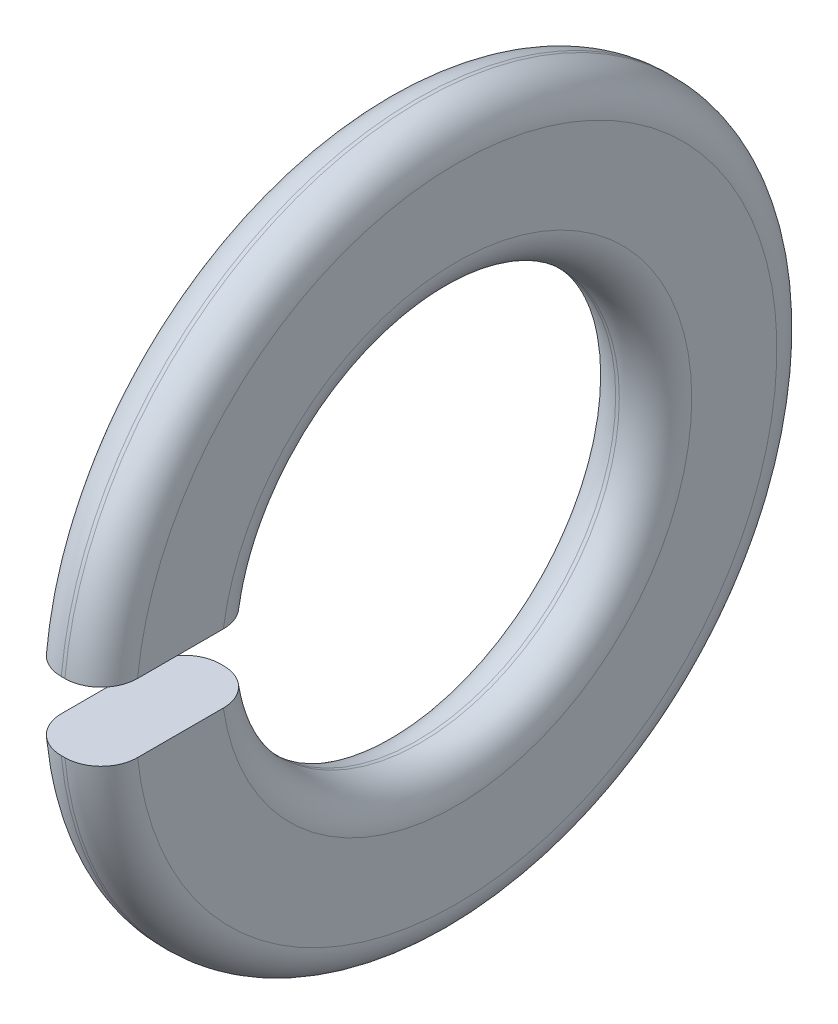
ISO-10303-21;
HEADER;
FILE_DESCRIPTION(('STEP AP214'),'2;1');
FILE_NAME('part.step','',(''),(''),'','','');
FILE_SCHEMA(('AUTOMOTIVE_DESIGN { 1 0 10303 214 1 1 1 1 }'));
ENDSEC;
DATA;
#1=APPLICATION_CONTEXT('core data for automotive mechanical design processes');
#2=APPLICATION_PROTOCOL_DEFINITION('international standard','automotive_design',2000,#1);
#3=PRODUCT_CONTEXT('',#1,'mechanical');
#4=PRODUCT('Part','Part','',(#3));
#5=PRODUCT_RELATED_PRODUCT_CATEGORY('part','',(#4));
#6=PRODUCT_DEFINITION_FORMATION('','',#4);
#7=PRODUCT_DEFINITION_CONTEXT('part definition',#1,'design');
#8=PRODUCT_DEFINITION('design','',#6,#7);
#9=PRODUCT_DEFINITION_SHAPE('','',#8);
#10=(LENGTH_UNIT() NAMED_UNIT(*) SI_UNIT(.MILLI.,.METRE.));
#11=(NAMED_UNIT(*) PLANE_ANGLE_UNIT() SI_UNIT($,.RADIAN.));
#12=(NAMED_UNIT(*) SI_UNIT($,.STERADIAN.) SOLID_ANGLE_UNIT());
#13=UNCERTAINTY_MEASURE_WITH_UNIT(LENGTH_MEASURE(1.E-05),#10,'distance_accuracy_value','');
#14=(GEOMETRIC_REPRESENTATION_CONTEXT(3) GLOBAL_UNCERTAINTY_ASSIGNED_CONTEXT((#13)) GLOBAL_UNIT_ASSIGNED_CONTEXT((#10,
#11,#12)) REPRESENTATION_CONTEXT('',''));
#15=CARTESIAN_POINT('',(0.,0.,0.));
#16=DIRECTION('',(0.,0.,1.));
#17=DIRECTION('',(1.,0.,0.));
#18=AXIS2_PLACEMENT_3D('',#15,#16,#17);
#19=CARTESIAN_POINT('',(-1.1,0.,0.));
#20=DIRECTION('',(-1.,0.,0.));
#21=DIRECTION('',(0.,0.,1.));
#22=AXIS2_PLACEMENT_3D('',#19,#20,#21);
#23=TOROIDAL_SURFACE('',#22,6.5,1.);
#24=CARTESIAN_POINT('',(-1.1,0.,0.));
#25=DIRECTION('',(-1.,0.,0.));
#26=DIRECTION('',(0.,0.,1.));
#27=AXIS2_PLACEMENT_3D('',#24,#25,#26);
#28=CIRCLE('',#27,5.5);
#29=CARTESIAN_POINT('',(-1.1,0.945,5.41820772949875));
#30=VERTEX_POINT('',#29);
#31=CARTESIAN_POINT('',(-1.1,-0.945,5.41820772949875));
#32=VERTEX_POINT('',#31);
#33=EDGE_CURVE('E123',#30,#32,#28,.T.);
#34=ORIENTED_EDGE('',*,*,#33,.F.);
#35=CARTESIAN_POINT('',(-1.50070397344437,0.945,5.50324566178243));
#36=CARTESIAN_POINT('',(-1.55223375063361,0.945,5.52611502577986));
#37=CARTESIAN_POINT('',(-1.60185220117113,0.945,5.55339994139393));
#38=CARTESIAN_POINT('',(-1.69582434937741,0.945,5.61596536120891));
#39=CARTESIAN_POINT('',(-1.74017082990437,0.945,5.65125663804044));
#40=CARTESIAN_POINT('',(-1.82228889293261,0.945,5.7287251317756));
#41=CARTESIAN_POINT('',(-1.86006736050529,0.945,5.77089504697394));
#42=CARTESIAN_POINT('',(-1.92807892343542,0.945,5.86091204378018));
#43=CARTESIAN_POINT('',(-1.95831385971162,0.945,5.90875773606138));
#44=CARTESIAN_POINT('',(-2.01071051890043,0.945,6.00927737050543));
#45=CARTESIAN_POINT('',(-2.0327907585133,0.945,6.06199379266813));
#46=CARTESIAN_POINT('',(-2.06786939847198,0.945,6.17036943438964));
#47=CARTESIAN_POINT('',(-2.08086696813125,0.945,6.22602892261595));
#48=CARTESIAN_POINT('',(-2.09748980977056,0.945,6.33918774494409));
#49=CARTESIAN_POINT('',(-2.10103920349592,0.945,6.39669824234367));
#50=CARTESIAN_POINT('',(-2.09843562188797,0.945,6.51150031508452));
#51=CARTESIAN_POINT('',(-2.09228255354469,0.945,6.56879188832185));
#52=CARTESIAN_POINT('',(-2.0704211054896,0.945,6.68153422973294));
#53=CARTESIAN_POINT('',(-2.05471107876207,0.945,6.7369846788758));
#54=CARTESIAN_POINT('',(-2.0141479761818,0.945,6.8444352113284));
#55=CARTESIAN_POINT('',(-1.98929515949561,0.945,6.89643539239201));
#56=CARTESIAN_POINT('',(-1.93130313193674,0.945,6.9951627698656));
#57=CARTESIAN_POINT('',(-1.89821545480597,0.945,7.04192023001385));
#58=CARTESIAN_POINT('',(-1.82459490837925,0.945,7.12915297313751));
#59=CARTESIAN_POINT('',(-1.78406237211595,0.945,7.16962853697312));
#60=CARTESIAN_POINT('',(-1.69708643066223,0.945,7.24276744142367));
#61=CARTESIAN_POINT('',(-1.65069837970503,0.945,7.27549660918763));
#62=CARTESIAN_POINT('',(-1.55305003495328,0.945,7.33262789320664));
#63=CARTESIAN_POINT('',(-1.50178996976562,0.945,7.35703039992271));
#64=CARTESIAN_POINT('',(-1.39629844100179,0.945,7.39661659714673));
#65=CARTESIAN_POINT('',(-1.34209426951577,0.945,7.41187303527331));
#66=CARTESIAN_POINT('',(-1.23188897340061,0.945,7.43301952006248));
#67=CARTESIAN_POINT('',(-1.17588790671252,0.945,7.43890986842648));
#68=CARTESIAN_POINT('',(-1.06396919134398,0.945,7.44114339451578));
#69=CARTESIAN_POINT('',(-1.0080524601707,0.945,7.43753283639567));
#70=CARTESIAN_POINT('',(-0.897620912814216,0.945,7.42097000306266));
#71=CARTESIAN_POINT('',(-0.843106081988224,0.945,7.40801782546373));
#72=CARTESIAN_POINT('',(-0.737046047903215,0.945,7.37316206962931));
#73=CARTESIAN_POINT('',(-0.685499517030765,0.945,7.35126252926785));
#74=CARTESIAN_POINT('',(-0.586794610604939,0.945,7.29915374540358));
#75=CARTESIAN_POINT('',(-0.539636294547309,0.945,7.26894438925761));
#76=CARTESIAN_POINT('',(-0.450834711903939,0.945,7.20095425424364));
#77=CARTESIAN_POINT('',(-0.409214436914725,0.945,7.16314345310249));
#78=CARTESIAN_POINT('',(-0.332854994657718,0.945,7.081117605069));
#79=CARTESIAN_POINT('',(-0.298116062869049,0.945,7.03690233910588));
#80=CARTESIAN_POINT('',(-0.236221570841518,0.945,6.94297172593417));
#81=CARTESIAN_POINT('',(-0.209124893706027,0.945,6.89321758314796));
#82=CARTESIAN_POINT('',(-0.163585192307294,0.945,6.78989581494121));
#83=CARTESIAN_POINT('',(-0.145142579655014,0.945,6.73632800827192));
#84=CARTESIAN_POINT('',(-0.117264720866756,0.945,6.6263910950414));
#85=CARTESIAN_POINT('',(-0.107910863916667,0.945,6.57000134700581));
#86=CARTESIAN_POINT('',(-0.0987300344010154,0.945,6.45645132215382));
#87=CARTESIAN_POINT('',(-0.0989034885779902,0.945,6.39929101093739));
#88=CARTESIAN_POINT('',(-0.108792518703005,0.945,6.28539288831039));
#89=CARTESIAN_POINT('',(-0.11857561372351,0.945,6.22866092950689));
#90=CARTESIAN_POINT('',(-0.147509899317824,0.945,6.11763679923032));
#91=CARTESIAN_POINT('',(-0.166661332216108,0.945,6.06334469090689));
#92=CARTESIAN_POINT('',(-0.213849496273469,0.945,5.958660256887));
#93=CARTESIAN_POINT('',(-0.241900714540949,0.945,5.90827445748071));
#94=CARTESIAN_POINT('',(-0.306113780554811,0.945,5.81296462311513));
#95=CARTESIAN_POINT('',(-0.342275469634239,0.945,5.76804048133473));
#96=CARTESIAN_POINT('',(-0.42146343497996,0.945,5.68524793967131));
#97=CARTESIAN_POINT('',(-0.464445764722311,0.945,5.64733752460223));
#98=CARTESIAN_POINT('',(-0.556232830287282,0.945,5.5793826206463));
#99=CARTESIAN_POINT('',(-0.60503692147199,0.945,5.54933726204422));
#100=CARTESIAN_POINT('',(-0.706421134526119,0.945,5.4983766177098));
#101=CARTESIAN_POINT('',(-0.758945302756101,0.945,5.47735001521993));
#102=CARTESIAN_POINT('',(-0.866820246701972,0.945,5.44453586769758));
#103=CARTESIAN_POINT('',(-0.922171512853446,0.945,5.43274993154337));
#104=CARTESIAN_POINT('',(-1.03339171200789,0.945,5.41888498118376));
#105=CARTESIAN_POINT('',(-1.08924636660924,0.945,5.41669069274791));
#106=CARTESIAN_POINT('',(-1.20047496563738,0.945,5.42176864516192));
#107=CARTESIAN_POINT('',(-1.25584943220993,0.945,5.42902881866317));
#108=CARTESIAN_POINT('',(-1.34288832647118,0.945,5.44801602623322));
#109=CARTESIAN_POINT('',(-1.37521994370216,0.945,5.45681628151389));
#110=CARTESIAN_POINT('',(-1.43882704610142,0.945,5.47764052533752));
#111=CARTESIAN_POINT('',(-1.47010254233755,0.945,5.48966448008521));
#112=CARTESIAN_POINT('',(-1.50070397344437,0.945,5.50324566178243));
#113=B_SPLINE_CURVE_WITH_KNOTS('',3,(#35,#36,#37,#38,#39,#40,#41,#42,#43,#44,#45,#46,#47,#48,
#49,#50,#51,#52,#53,#54,#55,#56,#57,#58,#59,#60,#61,#62,#63,#64,#65,#66,#67,#68,#69,#70,#71,#72,
#73,#74,#75,#76,#77,#78,#79,#80,#81,#82,#83,#84,#85,#86,#87,#88,#89,#90,#91,#92,#93,#94,#95,#96,
#97,#98,#99,#100,#101,#102,#103,#104,#105,#106,#107,#108,#109,#110,#111,#112),.UNSPECIFIED.,.T.,
.F.,(4,2,2,2,2,2,2,2,2,2,2,2,2,2,2,2,2,2,2,2,2,2,2,2,2,2,2,2,2,2,2,2,2,2,2,2,2,2,4),(0.,
0.169005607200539,0.338239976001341,0.507295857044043,0.676310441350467,0.846970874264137,
1.01764691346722,1.18968957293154,1.36173388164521,1.53380784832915,1.70587693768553,
1.87689516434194,2.04790574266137,2.21740627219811,2.38689885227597,2.5550247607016,
2.72314525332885,2.89044860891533,3.05775021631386,3.22497640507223,3.39220486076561,
3.56010724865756,3.72801538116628,3.8971839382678,4.06636054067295,4.23703851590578,
4.40772413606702,4.57961766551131,4.75151564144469,4.92369488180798,5.09587075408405,
5.26697922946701,5.43806877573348,5.60698117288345,5.77592297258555,5.94282871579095,
6.10952163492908,6.2098882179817,6.31025374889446),.UNSPECIFIED.);
#114=CARTESIAN_POINT('',(-2.1,0.945,6.43093888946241));
#115=VERTEX_POINT('',#114);
#116=EDGE_CURVE('E47',#30,#115,#113,.T.);
#117=ORIENTED_EDGE('',*,*,#116,.T.);
#118=CARTESIAN_POINT('',(-2.1,0.,0.));
#119=DIRECTION('',(-1.,0.,0.));
#120=DIRECTION('',(0.,0.,1.));
#121=AXIS2_PLACEMENT_3D('',#118,#119,#120);
#122=CIRCLE('',#121,6.5);
#123=CARTESIAN_POINT('',(-2.1,-0.945,6.43093888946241));
#124=VERTEX_POINT('',#123);
#125=EDGE_CURVE('E135',#115,#124,#122,.T.);
#126=ORIENTED_EDGE('',*,*,#125,.T.);
#127=CARTESIAN_POINT('',(-1.50070397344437,-0.945,5.50324566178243));
#128=CARTESIAN_POINT('',(-1.45000168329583,-0.945,5.48074908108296));
#129=CARTESIAN_POINT('',(-1.39737605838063,-0.945,5.46249401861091));
#130=CARTESIAN_POINT('',(-1.28976708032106,-0.945,5.43505980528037));
#131=CARTESIAN_POINT('',(-1.23478128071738,-0.945,5.42589032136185));
#132=CARTESIAN_POINT('',(-1.12406007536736,-0.945,5.41693807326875));
#133=CARTESIAN_POINT('',(-1.06832487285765,-0.945,5.4171528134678));
#134=CARTESIAN_POINT('',(-0.957699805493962,-0.945,5.42695823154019));
#135=CARTESIAN_POINT('',(-0.902809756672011,-0.945,5.43654683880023));
#136=CARTESIAN_POINT('',(-0.795512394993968,-0.945,5.46477049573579));
#137=CARTESIAN_POINT('',(-0.743100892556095,-0.945,5.48338963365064));
#138=CARTESIAN_POINT('',(-0.642111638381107,-0.945,5.52909806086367));
#139=CARTESIAN_POINT('',(-0.59353413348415,-0.945,5.5561878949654));
#140=CARTESIAN_POINT('',(-0.501181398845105,-0.945,5.61826859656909));
#141=CARTESIAN_POINT('',(-0.457445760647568,-0.945,5.65331833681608));
#142=CARTESIAN_POINT('',(-0.37638189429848,-0.945,5.73017446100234));
#143=CARTESIAN_POINT('',(-0.339054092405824,-0.945,5.77198129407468));
#144=CARTESIAN_POINT('',(-0.271338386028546,-0.945,5.86176201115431));
#145=CARTESIAN_POINT('',(-0.241049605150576,-0.945,5.90981066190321));
#146=CARTESIAN_POINT('',(-0.18886345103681,-0.945,6.0102672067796));
#147=CARTESIAN_POINT('',(-0.1669666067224,-0.945,6.06267537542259));
#148=CARTESIAN_POINT('',(-0.131949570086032,-0.945,6.17099798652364));
#149=CARTESIAN_POINT('',(-0.11893056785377,-0.945,6.22694516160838));
#150=CARTESIAN_POINT('',(-0.102426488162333,-0.945,6.34022949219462));
#151=CARTESIAN_POINT('',(-0.0989417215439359,-0.945,6.39756669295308));
#152=CARTESIAN_POINT('',(-0.101620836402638,-0.945,6.51225241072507));
#153=CARTESIAN_POINT('',(-0.107824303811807,-0.945,6.56960001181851));
#154=CARTESIAN_POINT('',(-0.129803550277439,-0.945,6.68243183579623));
#155=CARTESIAN_POINT('',(-0.14557923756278,-0.945,6.7379160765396));
#156=CARTESIAN_POINT('',(-0.186217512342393,-0.945,6.84523866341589));
#157=CARTESIAN_POINT('',(-0.211049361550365,-0.945,6.89708864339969));
#158=CARTESIAN_POINT('',(-0.269132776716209,-0.945,6.99583745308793));
#159=CARTESIAN_POINT('',(-0.302384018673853,-0.945,7.04273647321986));
#160=CARTESIAN_POINT('',(-0.376083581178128,-0.945,7.12984956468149));
#161=CARTESIAN_POINT('',(-0.416472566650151,-0.945,7.17011383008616));
#162=CARTESIAN_POINT('',(-0.503489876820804,-0.945,7.24321631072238));
#163=CARTESIAN_POINT('',(-0.550117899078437,-0.945,7.27605488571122));
#164=CARTESIAN_POINT('',(-0.647846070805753,-0.945,7.3330704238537));
#165=CARTESIAN_POINT('',(-0.698903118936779,-0.945,7.35732127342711));
#166=CARTESIAN_POINT('',(-0.804382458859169,-0.945,7.39684104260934));
#167=CARTESIAN_POINT('',(-0.858804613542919,-0.945,7.41211032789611));
#168=CARTESIAN_POINT('',(-0.969078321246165,-0.945,7.43313942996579));
#169=CARTESIAN_POINT('',(-1.0249178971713,-0.945,7.43896208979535));
#170=CARTESIAN_POINT('',(-1.13677960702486,-0.945,7.4411217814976));
#171=CARTESIAN_POINT('',(-1.19280173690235,-0.945,7.43745902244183));
#172=CARTESIAN_POINT('',(-1.30327861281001,-0.945,7.42077999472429));
#173=CARTESIAN_POINT('',(-1.35773720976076,-0.945,7.40778921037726));
#174=CARTESIAN_POINT('',(-1.46370638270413,-0.945,7.37286553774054));
#175=CARTESIAN_POINT('',(-1.51521695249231,-0.945,7.35093263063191));
#176=CARTESIAN_POINT('',(-1.6139382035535,-0.945,7.29871776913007));
#177=CARTESIAN_POINT('',(-1.6611407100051,-0.945,7.26842036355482));
#178=CARTESIAN_POINT('',(-1.74982766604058,-0.945,7.20037492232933));
#179=CARTESIAN_POINT('',(-1.79131198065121,-0.945,7.16262671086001));
#180=CARTESIAN_POINT('',(-1.86765747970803,-0.945,7.08051754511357));
#181=CARTESIAN_POINT('',(-1.90247764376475,-0.945,7.03611845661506));
#182=CARTESIAN_POINT('',(-1.96424386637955,-0.945,6.94214578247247));
#183=CARTESIAN_POINT('',(-1.99118957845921,-0.945,6.89257196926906));
#184=CARTESIAN_POINT('',(-2.03668822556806,-0.945,6.78920642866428));
#185=CARTESIAN_POINT('',(-2.05516764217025,-0.945,6.73538234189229));
#186=CARTESIAN_POINT('',(-2.08291216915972,-0.945,6.62540964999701));
#187=CARTESIAN_POINT('',(-2.09217681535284,-0.945,6.56926092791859));
#188=CARTESIAN_POINT('',(-2.10130025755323,-0.945,6.45572670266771));
#189=CARTESIAN_POINT('',(-2.10107901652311,-0.945,6.39833476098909));
#190=CARTESIAN_POINT('',(-2.09105396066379,-0.945,6.28439521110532));
#191=CARTESIAN_POINT('',(-2.08125014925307,-0.945,6.22784760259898));
#192=CARTESIAN_POINT('',(-2.0522661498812,-0.945,6.11692458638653));
#193=CARTESIAN_POINT('',(-2.03304235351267,-0.945,6.06256056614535));
#194=CARTESIAN_POINT('',(-1.98571606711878,-0.945,5.9578253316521));
#195=CARTESIAN_POINT('',(-1.95761135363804,-0.945,5.90745512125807));
#196=CARTESIAN_POINT('',(-1.8933533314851,-0.945,5.81227024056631));
#197=CARTESIAN_POINT('',(-1.85721385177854,-0.945,5.76744622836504));
#198=CARTESIAN_POINT('',(-1.77787852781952,-0.945,5.6846209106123));
#199=CARTESIAN_POINT('',(-1.73469159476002,-0.945,5.64661111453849));
#200=CARTESIAN_POINT('',(-1.65939800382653,-0.945,5.59101230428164));
#201=CARTESIAN_POINT('',(-1.62902044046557,-0.945,5.57104068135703));
#202=CARTESIAN_POINT('',(-1.56627138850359,-0.945,5.53452188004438));
#203=CARTESIAN_POINT('',(-1.53389991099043,-0.945,5.51797468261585));
#204=CARTESIAN_POINT('',(-1.50070397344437,-0.945,5.50324566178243));
#205=B_SPLINE_CURVE_WITH_KNOTS('',3,(#127,#128,#129,#130,#131,#132,#133,#134,#135,#136,#137,
#138,#139,#140,#141,#142,#143,#144,#145,#146,#147,#148,#149,#150,#151,#152,#153,#154,#155,#156,
#157,#158,#159,#160,#161,#162,#163,#164,#165,#166,#167,#168,#169,#170,#171,#172,#173,#174,#175,
#176,#177,#178,#179,#180,#181,#182,#183,#184,#185,#186,#187,#188,#189,#190,#191,#192,#193,#194,
#195,#196,#197,#198,#199,#200,#201,#202,#203,#204),.UNSPECIFIED.,.T.,.F.,(4,2,2,2,2,2,2,2,2,2,2,
2,2,2,2,2,2,2,2,2,2,2,2,2,2,2,2,2,2,2,2,2,2,2,2,2,2,2,4),(0.,0.166275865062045,
0.332728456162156,0.499136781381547,0.665508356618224,0.831587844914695,0.99767801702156,
1.16503911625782,1.33241134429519,1.50201426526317,1.67162787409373,1.84314380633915,
2.01466533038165,2.18688952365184,2.35911206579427,2.53075541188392,2.70239215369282,
2.87266401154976,3.04292761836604,3.21168853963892,3.38044258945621,3.54806934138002,
3.71569239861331,3.88285924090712,4.05002643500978,4.21750451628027,4.38498655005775,
4.5534684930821,4.72195784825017,4.89188379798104,5.06181830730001,5.2331869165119,
5.40455546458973,5.57672494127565,5.74893755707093,5.92085603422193,6.09255878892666,
6.20142396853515,6.31028854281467),.UNSPECIFIED.);
#206=EDGE_CURVE('E114',#124,#32,#205,.T.);
#207=ORIENTED_EDGE('',*,*,#206,.T.);
#208=EDGE_LOOP('',(#34,#117,#126,#207));
#209=FACE_BOUND('',#208,.T.);
#210=ADVANCED_FACE('F33',(#209),#23,.T.);
#211=CARTESIAN_POINT('',(-2.1,8.85,0.));
#212=DIRECTION('',(1.,0.,0.));
#213=DIRECTION('',(0.,0.,-1.));
#214=AXIS2_PLACEMENT_3D('',#211,#212,#213);
#215=PLANE('',#214);
#216=DIRECTION('',(0.,0.,-1.));
#217=VECTOR('',#216,1.);
#218=CARTESIAN_POINT('',(-2.1,0.945,10.047));
#219=LINE('',#218,#217);
#220=CARTESIAN_POINT('',(-2.1,0.945,8.7994019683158));
#221=VERTEX_POINT('',#220);
#222=EDGE_CURVE('E103',#221,#115,#219,.T.);
#223=ORIENTED_EDGE('',*,*,#222,.F.);
#224=CARTESIAN_POINT('',(-2.1,0.,0.));
#225=DIRECTION('',(-1.,0.,0.));
#226=DIRECTION('',(0.,0.,1.));
#227=AXIS2_PLACEMENT_3D('',#224,#225,#226);
#228=CIRCLE('',#227,8.85);
#229=CARTESIAN_POINT('',(-2.1,-0.945,8.7994019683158));
#230=VERTEX_POINT('',#229);
#231=EDGE_CURVE('E132',#221,#230,#228,.T.);
#232=ORIENTED_EDGE('',*,*,#231,.T.);
#233=DIRECTION('',(0.,0.,1.));
#234=VECTOR('',#233,1.);
#235=CARTESIAN_POINT('',(-2.1,-0.945,0.));
#236=LINE('',#235,#234);
#237=EDGE_CURVE('E115',#124,#230,#236,.T.);
#238=ORIENTED_EDGE('',*,*,#237,.F.);
#239=ORIENTED_EDGE('',*,*,#125,.F.);
#240=EDGE_LOOP('',(#223,#232,#238,#239));
#241=FACE_BOUND('',#240,.T.);
#242=ADVANCED_FACE('F201',(#241),#215,.F.);
#243=CARTESIAN_POINT('',(-1.1,0.,0.));
#244=DIRECTION('',(-1.,0.,0.));
#245=DIRECTION('',(0.,0.,1.));
#246=AXIS2_PLACEMENT_3D('',#243,#244,#245);
#247=TOROIDAL_SURFACE('',#246,8.85,1.);
#248=CARTESIAN_POINT('',(-1.51374410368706,0.945,7.8831675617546));
#249=CARTESIAN_POINT('',(-1.46297774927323,0.945,7.85993342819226));
#250=CARTESIAN_POINT('',(-1.41021910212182,0.945,7.84095779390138));
#251=CARTESIAN_POINT('',(-1.30222277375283,0.945,7.81211639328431));
#252=CARTESIAN_POINT('',(-1.24698234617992,0.945,7.80226099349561));
#253=CARTESIAN_POINT('',(-1.13564607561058,0.945,7.79197961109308));
#254=CARTESIAN_POINT('',(-1.07955055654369,0.945,7.79155014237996));
#255=CARTESIAN_POINT('',(-0.968100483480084,0.945,7.80012709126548));
#256=CARTESIAN_POINT('',(-0.912745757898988,0.945,7.80913128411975));
#257=CARTESIAN_POINT('',(-0.804383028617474,0.945,7.83629050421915));
#258=CARTESIAN_POINT('',(-0.751372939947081,0.945,7.85443721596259));
#259=CARTESIAN_POINT('',(-0.64913463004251,0.945,7.89934331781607));
#260=CARTESIAN_POINT('',(-0.599906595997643,0.945,7.92610313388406));
#261=CARTESIAN_POINT('',(-0.506441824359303,0.945,7.98756331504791));
#262=CARTESIAN_POINT('',(-0.462222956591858,0.945,8.02229084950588));
#263=CARTESIAN_POINT('',(-0.380195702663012,0.945,8.09863281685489));
#264=CARTESIAN_POINT('',(-0.342387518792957,0.945,8.14024746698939));
#265=CARTESIAN_POINT('',(-0.2739932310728,0.945,8.22947078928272));
#266=CARTESIAN_POINT('',(-0.243455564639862,0.945,8.27711659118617));
#267=CARTESIAN_POINT('',(-0.190757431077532,0.945,8.37683513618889));
#268=CARTESIAN_POINT('',(-0.168597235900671,0.945,8.4289080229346));
#269=CARTESIAN_POINT('',(-0.133154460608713,0.945,8.53633528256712));
#270=CARTESIAN_POINT('',(-0.119925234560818,0.945,8.59170726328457));
#271=CARTESIAN_POINT('',(-0.102923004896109,0.945,8.7038849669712));
#272=CARTESIAN_POINT('',(-0.0991501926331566,0.945,8.76069071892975));
#273=CARTESIAN_POINT('',(-0.101173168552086,0.945,8.87428292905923));
#274=CARTESIAN_POINT('',(-0.106994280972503,0.945,8.93106893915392));
#275=CARTESIAN_POINT('',(-0.128099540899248,0.945,9.04285500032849));
#276=CARTESIAN_POINT('',(-0.143383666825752,0.945,9.09785505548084));
#277=CARTESIAN_POINT('',(-0.182971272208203,0.945,9.20442756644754));
#278=CARTESIAN_POINT('',(-0.207263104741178,0.945,9.25600434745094));
#279=CARTESIAN_POINT('',(-0.264195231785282,0.945,9.35432447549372));
#280=CARTESIAN_POINT('',(-0.296835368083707,0.945,9.40106791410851));
#281=CARTESIAN_POINT('',(-0.369398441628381,0.945,9.48818746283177));
#282=CARTESIAN_POINT('',(-0.409291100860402,0.945,9.528588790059));
#283=CARTESIAN_POINT('',(-0.495322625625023,0.945,9.60207996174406));
#284=CARTESIAN_POINT('',(-0.541461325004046,0.945,9.63517000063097));
#285=CARTESIAN_POINT('',(-0.638430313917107,0.945,9.69292749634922));
#286=CARTESIAN_POINT('',(-0.689236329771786,0.945,9.71763570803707));
#287=CARTESIAN_POINT('',(-0.794286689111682,0.945,9.75813314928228));
#288=CARTESIAN_POINT('',(-0.848530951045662,0.945,9.77392259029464));
#289=CARTESIAN_POINT('',(-0.958688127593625,0.945,9.79607608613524));
#290=CARTESIAN_POINT('',(-1.01459362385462,0.945,9.80247703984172));
#291=CARTESIAN_POINT('',(-1.12668443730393,0.945,9.8057846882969));
#292=CARTESIAN_POINT('',(-1.18286975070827,0.945,9.80269151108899));
#293=CARTESIAN_POINT('',(-1.29382522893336,0.945,9.78711475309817));
#294=CARTESIAN_POINT('',(-1.34859763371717,0.945,9.77464711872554));
#295=CARTESIAN_POINT('',(-1.45527505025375,0.945,9.74070239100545));
#296=CARTESIAN_POINT('',(-1.50718005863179,0.945,9.7192252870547));
#297=CARTESIAN_POINT('',(-1.60671107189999,0.945,9.66785610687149));
#298=CARTESIAN_POINT('',(-1.65433261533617,0.945,9.63795538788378));
#299=CARTESIAN_POINT('',(-1.74390196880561,0.945,9.5706091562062));
#300=CARTESIAN_POINT('',(-1.78584970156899,0.945,9.53316354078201));
#301=CARTESIAN_POINT('',(-1.8630397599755,0.945,9.4516564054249));
#302=CARTESIAN_POINT('',(-1.89825844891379,0.945,9.40757250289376));
#303=CARTESIAN_POINT('',(-1.96083681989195,0.945,9.31414133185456));
#304=CARTESIAN_POINT('',(-1.98819629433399,0.945,9.26479392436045));
#305=CARTESIAN_POINT('',(-2.03441998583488,0.945,9.1619828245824));
#306=CARTESIAN_POINT('',(-2.05324266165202,0.945,9.10850045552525));
#307=CARTESIAN_POINT('',(-2.08168705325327,0.945,8.9991424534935));
#308=CARTESIAN_POINT('',(-2.09130850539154,0.945,8.94326675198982));
#309=CARTESIAN_POINT('',(-2.10111590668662,0.945,8.83043835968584));
#310=CARTESIAN_POINT('',(-2.10125901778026,0.945,8.77348194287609));
#311=CARTESIAN_POINT('',(-2.09200410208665,0.945,8.66035125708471));
#312=CARTESIAN_POINT('',(-2.08260626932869,0.945,8.60417697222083));
#313=CARTESIAN_POINT('',(-2.0545027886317,0.945,8.49407938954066));
#314=CARTESIAN_POINT('',(-2.03577744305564,0.945,8.44016111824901));
#315=CARTESIAN_POINT('',(-1.98952121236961,0.945,8.33622552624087));
#316=CARTESIAN_POINT('',(-1.96198815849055,0.945,8.28620917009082));
#317=CARTESIAN_POINT('',(-1.89892350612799,0.945,8.19158472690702));
#318=CARTESIAN_POINT('',(-1.86340041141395,0.945,8.14697096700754));
#319=CARTESIAN_POINT('',(-1.78535639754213,0.945,8.06442318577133));
#320=CARTESIAN_POINT('',(-1.74284413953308,0.945,8.02648101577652));
#321=CARTESIAN_POINT('',(-1.66890365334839,0.945,7.97100176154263));
#322=CARTESIAN_POINT('',(-1.63920807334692,0.945,7.95111428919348));
#323=CARTESIAN_POINT('',(-1.57786129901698,0.945,7.91462651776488));
#324=CARTESIAN_POINT('',(-1.54621010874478,0.945,7.89802621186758));
#325=CARTESIAN_POINT('',(-1.51374410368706,0.945,7.8831675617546));
#326=B_SPLINE_CURVE_WITH_KNOTS('',3,(#248,#249,#250,#251,#252,#253,#254,#255,#256,#257,#258,
#259,#260,#261,#262,#263,#264,#265,#266,#267,#268,#269,#270,#271,#272,#273,#274,#275,#276,#277,
#278,#279,#280,#281,#282,#283,#284,#285,#286,#287,#288,#289,#290,#291,#292,#293,#294,#295,#296,
#297,#298,#299,#300,#301,#302,#303,#304,#305,#306,#307,#308,#309,#310,#311,#312,#313,#314,#315,
#316,#317,#318,#319,#320,#321,#322,#323,#324,#325),.UNSPECIFIED.,.T.,.F.,(4,2,2,2,2,2,2,2,2,2,2,
2,2,2,2,2,2,2,2,2,2,2,2,2,2,2,2,2,2,2,2,2,2,2,2,2,2,2,4),(0.,0.167361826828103,
0.334913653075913,0.502403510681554,0.669853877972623,0.83715221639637,1.00445882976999,
1.1723446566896,1.340235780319,1.5092159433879,1.67820159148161,1.84818804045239,2.018177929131,
2.18861724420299,2.35905617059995,2.52927548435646,2.6994915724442,2.86901270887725,
3.03852933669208,3.20720949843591,3.37588566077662,3.54389709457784,3.71190626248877,
3.87963028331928,4.04735450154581,4.21525143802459,4.3831506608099,4.55162922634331,
4.72011224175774,4.88940654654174,5.05870570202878,5.22876996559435,5.39883077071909,
5.56925223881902,5.73971570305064,5.90999859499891,6.08007203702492,6.18710318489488,
6.29413411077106),.UNSPECIFIED.);
#327=CARTESIAN_POINT('',(-1.1,0.945,9.80456398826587));
#328=VERTEX_POINT('',#327);
#329=EDGE_CURVE('E146',#328,#221,#326,.T.);
#330=ORIENTED_EDGE('',*,*,#329,.F.);
#331=CARTESIAN_POINT('',(-1.1,0.,0.));
#332=DIRECTION('',(-1.,0.,0.));
#333=DIRECTION('',(0.,0.,1.));
#334=AXIS2_PLACEMENT_3D('',#331,#332,#333);
#335=CIRCLE('',#334,9.85);
#336=CARTESIAN_POINT('',(-1.1,-0.945,9.80456398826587));
#337=VERTEX_POINT('',#336);
#338=EDGE_CURVE('E129',#328,#337,#335,.T.);
#339=ORIENTED_EDGE('',*,*,#338,.T.);
#340=CARTESIAN_POINT('',(-1.51374410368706,-0.945,7.8831675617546));
#341=CARTESIAN_POINT('',(-1.5649154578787,-0.945,7.90659262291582));
#342=CARTESIAN_POINT('',(-1.61413699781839,-0.945,7.93437918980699));
#343=CARTESIAN_POINT('',(-1.70724621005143,-0.945,7.9978601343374));
#344=CARTESIAN_POINT('',(-1.75112699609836,-0.945,8.03356455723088));
#345=CARTESIAN_POINT('',(-1.83225188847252,-0.945,8.11179861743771));
#346=CARTESIAN_POINT('',(-1.86950104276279,-0.945,8.1543230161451));
#347=CARTESIAN_POINT('',(-1.9363617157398,-0.945,8.24498320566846));
#348=CARTESIAN_POINT('',(-1.96597510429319,-0.945,8.29311761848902));
#349=CARTESIAN_POINT('',(-2.0168949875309,-0.945,8.39389407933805));
#350=CARTESIAN_POINT('',(-2.03815996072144,-0.945,8.44655710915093));
#351=CARTESIAN_POINT('',(-2.0715910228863,-0.945,8.55469869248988));
#352=CARTESIAN_POINT('',(-2.08375650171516,-0.945,8.6101774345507));
#353=CARTESIAN_POINT('',(-2.09868259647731,-0.945,8.72262979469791));
#354=CARTESIAN_POINT('',(-2.10140254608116,-0.945,8.77960881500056));
#355=CARTESIAN_POINT('',(-2.09724278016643,-0.945,8.89321588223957));
#356=CARTESIAN_POINT('',(-2.09036300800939,-0.945,8.94984392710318));
#357=CARTESIAN_POINT('',(-2.06718195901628,-0.945,9.06116283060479));
#358=CARTESIAN_POINT('',(-2.05087683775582,-0.945,9.11585288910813));
#359=CARTESIAN_POINT('',(-2.00928858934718,-0.945,9.22170628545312));
#360=CARTESIAN_POINT('',(-1.98400559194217,-0.945,9.27286967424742));
#361=CARTESIAN_POINT('',(-1.92525512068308,-0.945,9.37004588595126));
#362=CARTESIAN_POINT('',(-1.89181290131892,-0.945,9.41607397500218));
#363=CARTESIAN_POINT('',(-1.81764112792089,-0.945,9.50182780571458));
#364=CARTESIAN_POINT('',(-1.77691174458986,-0.945,9.54155369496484));
#365=CARTESIAN_POINT('',(-1.68953106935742,-0.945,9.61337124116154));
#366=CARTESIAN_POINT('',(-1.64290917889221,-0.945,9.64549867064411));
#367=CARTESIAN_POINT('',(-1.54491358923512,-0.945,9.70142803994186));
#368=CARTESIAN_POINT('',(-1.49354001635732,-0.945,9.72523020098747));
#369=CARTESIAN_POINT('',(-1.38775281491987,-0.945,9.76372301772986));
#370=CARTESIAN_POINT('',(-1.33335418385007,-0.945,9.77845489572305));
#371=CARTESIAN_POINT('',(-1.2228531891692,-0.945,9.79854810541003));
#372=CARTESIAN_POINT('',(-1.16675085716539,-0.945,9.80390961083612));
#373=CARTESIAN_POINT('',(-1.0546027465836,-0.945,9.80510384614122));
#374=CARTESIAN_POINT('',(-0.998557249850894,-0.945,9.80096322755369));
#375=CARTESIAN_POINT('',(-0.887957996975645,-0.945,9.78332908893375));
#376=CARTESIAN_POINT('',(-0.833404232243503,-0.945,9.76983562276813));
#377=CARTESIAN_POINT('',(-0.727344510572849,-0.945,9.73389136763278));
#378=CARTESIAN_POINT('',(-0.675837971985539,-0.945,9.71144229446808));
#379=CARTESIAN_POINT('',(-0.577312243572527,-0.945,9.65823597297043));
#380=CARTESIAN_POINT('',(-0.530293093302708,-0.945,9.62747865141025));
#381=CARTESIAN_POINT('',(-0.441948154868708,-0.945,9.55845415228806));
#382=CARTESIAN_POINT('',(-0.400636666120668,-0.945,9.52016867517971));
#383=CARTESIAN_POINT('',(-0.324993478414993,-0.945,9.43723249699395));
#384=CARTESIAN_POINT('',(-0.290661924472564,-0.945,9.39258166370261));
#385=CARTESIAN_POINT('',(-0.229790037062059,-0.945,9.29797462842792));
#386=CARTESIAN_POINT('',(-0.203284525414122,-0.945,9.24799602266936));
#387=CARTESIAN_POINT('',(-0.158993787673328,-0.945,9.14431395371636));
#388=CARTESIAN_POINT('',(-0.141208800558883,-0.945,9.09061038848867));
#389=CARTESIAN_POINT('',(-0.11477557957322,-0.945,8.98072223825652));
#390=CARTESIAN_POINT('',(-0.10617235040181,-0.945,8.9245268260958));
#391=CARTESIAN_POINT('',(-0.0984865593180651,-0.945,8.81148846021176));
#392=CARTESIAN_POINT('',(-0.0994042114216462,-0.945,8.75464549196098));
#393=CARTESIAN_POINT('',(-0.110749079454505,-0.945,8.64171643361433));
#394=CARTESIAN_POINT('',(-0.121209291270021,-0.945,8.58563365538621));
#395=CARTESIAN_POINT('',(-0.151393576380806,-0.945,8.47601810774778));
#396=CARTESIAN_POINT('',(-0.171117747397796,-0.945,8.42248536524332));
#397=CARTESIAN_POINT('',(-0.219289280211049,-0.945,8.31948288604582));
#398=CARTESIAN_POINT('',(-0.247738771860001,-0.945,8.27001414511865));
#399=CARTESIAN_POINT('',(-0.312568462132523,-0.945,8.17657799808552));
#400=CARTESIAN_POINT('',(-0.348948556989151,-0.945,8.13261052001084));
#401=CARTESIAN_POINT('',(-0.428470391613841,-0.945,8.05160940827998));
#402=CARTESIAN_POINT('',(-0.471586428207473,-0.945,8.0145505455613));
#403=CARTESIAN_POINT('',(-0.563461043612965,-0.945,7.94825521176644));
#404=CARTESIAN_POINT('',(-0.612219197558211,-0.945,7.91901815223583));
#405=CARTESIAN_POINT('',(-0.713652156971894,-0.945,7.8693996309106));
#406=CARTESIAN_POINT('',(-0.766299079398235,-0.945,7.84896116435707));
#407=CARTESIAN_POINT('',(-0.874303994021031,-0.945,7.81726850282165));
#408=CARTESIAN_POINT('',(-0.929662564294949,-0.945,7.80601627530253));
#409=CARTESIAN_POINT('',(-1.04117296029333,-0.945,7.79307627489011));
#410=CARTESIAN_POINT('',(-1.09731878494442,-0.945,7.79133648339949));
#411=CARTESIAN_POINT('',(-1.20905352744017,-0.945,7.79733870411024));
#412=CARTESIAN_POINT('',(-1.26464304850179,-0.945,7.8050689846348));
#413=CARTESIAN_POINT('',(-1.35261004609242,-0.945,7.82496668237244));
#414=CARTESIAN_POINT('',(-1.38566278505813,-0.945,7.83426854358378));
#415=CARTESIAN_POINT('',(-1.45063322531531,-0.945,7.85622923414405));
#416=CARTESIAN_POINT('',(-1.48255093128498,-0.945,7.86888804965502));
#417=CARTESIAN_POINT('',(-1.51374410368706,-0.945,7.8831675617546));
#418=B_SPLINE_CURVE_WITH_KNOTS('',3,(#340,#341,#342,#343,#344,#345,#346,#347,#348,#349,#350,
#351,#352,#353,#354,#355,#356,#357,#358,#359,#360,#361,#362,#363,#364,#365,#366,#367,#368,#369,
#370,#371,#372,#373,#374,#375,#376,#377,#378,#379,#380,#381,#382,#383,#384,#385,#386,#387,#388,
#389,#390,#391,#392,#393,#394,#395,#396,#397,#398,#399,#400,#401,#402,#403,#404,#405,#406,#407,
#408,#409,#410,#411,#412,#413,#414,#415,#416,#417),.UNSPECIFIED.,.T.,.F.,(4,2,2,2,2,2,2,2,2,2,2,
2,2,2,2,2,2,2,2,2,2,2,2,2,2,2,2,2,2,2,2,2,2,2,2,2,2,2,4),(0.,0.168708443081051,0.33763216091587,
0.506426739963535,0.675179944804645,0.84476213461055,1.01435569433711,1.18467851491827,
1.35500234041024,1.52539568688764,1.69578657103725,1.865656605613,2.03552266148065,
2.20457234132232,2.37361752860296,2.54188866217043,2.71015667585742,2.87795330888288,
3.04574897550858,3.21351250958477,3.3812775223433,3.54945549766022,3.71763696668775,
3.88655585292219,4.05547936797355,4.2252271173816,4.3949786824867,4.56531944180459,
4.73566199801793,4.9060461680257,5.07642810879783,5.24617510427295,5.41590932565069,
5.58452668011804,5.7531801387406,5.92091038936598,6.08843306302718,6.19127523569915,
6.29411698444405),.UNSPECIFIED.);
#419=EDGE_CURVE('E194',#230,#337,#418,.T.);
#420=ORIENTED_EDGE('',*,*,#419,.F.);
#421=ORIENTED_EDGE('',*,*,#231,.F.);
#422=EDGE_LOOP('',(#330,#339,#420,#421));
#423=FACE_BOUND('',#422,.T.);
#424=ADVANCED_FACE('F155',(#423),#247,.T.);
#425=CARTESIAN_POINT('',(-34.9249999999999,0.,0.));
#426=DIRECTION('',(-1.,0.,0.));
#427=DIRECTION('',(0.,0.,1.));
#428=AXIS2_PLACEMENT_3D('',#425,#426,#427);
#429=CYLINDRICAL_SURFACE('',#428,9.85);
#430=DIRECTION('',(-1.,0.,0.));
#431=VECTOR('',#430,1.);
#432=CARTESIAN_POINT('',(-34.9249999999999,0.945,9.80456398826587));
#433=LINE('',#432,#431);
#434=CARTESIAN_POINT('',(-1.,0.945,9.80456398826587));
#435=VERTEX_POINT('',#434);
#436=EDGE_CURVE('E147',#435,#328,#433,.T.);
#437=ORIENTED_EDGE('',*,*,#436,.F.);
#438=CARTESIAN_POINT('',(-1.,0.,0.));
#439=DIRECTION('',(-1.,0.,0.));
#440=DIRECTION('',(0.,0.,1.));
#441=AXIS2_PLACEMENT_3D('',#438,#439,#440);
#442=CIRCLE('',#441,9.85);
#443=CARTESIAN_POINT('',(-1.,-0.945,9.80456398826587));
#444=VERTEX_POINT('',#443);
#445=EDGE_CURVE('E121',#435,#444,#442,.T.);
#446=ORIENTED_EDGE('',*,*,#445,.T.);
#447=DIRECTION('',(-1.,0.,0.));
#448=VECTOR('',#447,1.);
#449=CARTESIAN_POINT('',(-34.9249999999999,-0.945,9.80456398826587));
#450=LINE('',#449,#448);
#451=EDGE_CURVE('E191',#337,#444,#450,.F.);
#452=ORIENTED_EDGE('',*,*,#451,.F.);
#453=ORIENTED_EDGE('',*,*,#338,.F.);
#454=EDGE_LOOP('',(#437,#446,#452,#453));
#455=FACE_BOUND('',#454,.T.);
#456=ADVANCED_FACE('F184',(#455),#429,.T.);
#457=CARTESIAN_POINT('',(-1.,0.,0.));
#458=DIRECTION('',(-1.,0.,0.));
#459=DIRECTION('',(0.,0.,1.));
#460=AXIS2_PLACEMENT_3D('',#457,#458,#459);
#461=TOROIDAL_SURFACE('',#460,8.85,1.);
#462=CARTESIAN_POINT('',(-0.586255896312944,0.945,7.8831675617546));
#463=CARTESIAN_POINT('',(-0.535084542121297,0.945,7.90659262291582));
#464=CARTESIAN_POINT('',(-0.485863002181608,0.945,7.93437918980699));
#465=CARTESIAN_POINT('',(-0.392753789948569,0.945,7.9978601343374));
#466=CARTESIAN_POINT('',(-0.34887300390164,0.945,8.03356455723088));
#467=CARTESIAN_POINT('',(-0.267748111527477,0.945,8.11179861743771));
#468=CARTESIAN_POINT('',(-0.230498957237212,0.945,8.15432301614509));
#469=CARTESIAN_POINT('',(-0.163638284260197,0.945,8.24498320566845));
#470=CARTESIAN_POINT('',(-0.134024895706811,0.945,8.29311761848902));
#471=CARTESIAN_POINT('',(-0.0831050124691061,0.945,8.39389407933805));
#472=CARTESIAN_POINT('',(-0.0618400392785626,0.945,8.44655710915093));
#473=CARTESIAN_POINT('',(-0.0284089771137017,0.945,8.55469869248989));
#474=CARTESIAN_POINT('',(-0.0162434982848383,0.945,8.6101774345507));
#475=CARTESIAN_POINT('',(-0.00131740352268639,0.945,8.72262979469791));
#476=CARTESIAN_POINT('',(0.00140254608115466,0.945,8.77960881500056));
#477=CARTESIAN_POINT('',(-0.00275721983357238,0.945,8.89321588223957));
#478=CARTESIAN_POINT('',(-0.00963699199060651,0.945,8.94984392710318));
#479=CARTESIAN_POINT('',(-0.0328180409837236,0.945,9.06116283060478));
#480=CARTESIAN_POINT('',(-0.0491231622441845,0.945,9.11585288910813));
#481=CARTESIAN_POINT('',(-0.0907114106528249,0.945,9.22170628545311));
#482=CARTESIAN_POINT('',(-0.11599440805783,0.945,9.27286967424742));
#483=CARTESIAN_POINT('',(-0.174744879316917,0.945,9.37004588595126));
#484=CARTESIAN_POINT('',(-0.208187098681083,0.945,9.41607397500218));
#485=CARTESIAN_POINT('',(-0.282358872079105,0.945,9.50182780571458));
#486=CARTESIAN_POINT('',(-0.323088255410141,0.945,9.54155369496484));
#487=CARTESIAN_POINT('',(-0.410468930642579,0.945,9.61337124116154));
#488=CARTESIAN_POINT('',(-0.457090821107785,0.945,9.64549867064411));
#489=CARTESIAN_POINT('',(-0.555086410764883,0.945,9.70142803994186));
#490=CARTESIAN_POINT('',(-0.606459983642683,0.945,9.72523020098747));
#491=CARTESIAN_POINT('',(-0.71224718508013,0.945,9.76372301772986));
#492=CARTESIAN_POINT('',(-0.766645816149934,0.945,9.77845489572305));
#493=CARTESIAN_POINT('',(-0.877146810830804,0.945,9.79854810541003));
#494=CARTESIAN_POINT('',(-0.933249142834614,0.945,9.80390961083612));
#495=CARTESIAN_POINT('',(-1.0453972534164,0.945,9.80510384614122));
#496=CARTESIAN_POINT('',(-1.10144275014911,0.945,9.80096322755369));
#497=CARTESIAN_POINT('',(-1.21204200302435,0.945,9.78332908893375));
#498=CARTESIAN_POINT('',(-1.2665957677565,0.945,9.76983562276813));
#499=CARTESIAN_POINT('',(-1.37265548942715,0.945,9.73389136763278));
#500=CARTESIAN_POINT('',(-1.42416202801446,0.945,9.71144229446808));
#501=CARTESIAN_POINT('',(-1.52268775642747,0.945,9.65823597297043));
#502=CARTESIAN_POINT('',(-1.56970690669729,0.945,9.62747865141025));
#503=CARTESIAN_POINT('',(-1.65805184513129,0.945,9.55845415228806));
#504=CARTESIAN_POINT('',(-1.69936333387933,0.945,9.52016867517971));
#505=CARTESIAN_POINT('',(-1.77500652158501,0.945,9.43723249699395));
#506=CARTESIAN_POINT('',(-1.80933807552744,0.945,9.39258166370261));
#507=CARTESIAN_POINT('',(-1.87020996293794,0.945,9.29797462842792));
#508=CARTESIAN_POINT('',(-1.89671547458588,0.945,9.24799602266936));
#509=CARTESIAN_POINT('',(-1.94100621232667,0.945,9.14431395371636));
#510=CARTESIAN_POINT('',(-1.95879119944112,0.945,9.09061038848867));
#511=CARTESIAN_POINT('',(-1.98522442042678,0.945,8.98072223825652));
#512=CARTESIAN_POINT('',(-1.99382764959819,0.945,8.9245268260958));
#513=CARTESIAN_POINT('',(-2.00151344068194,0.945,8.81148846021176));
#514=CARTESIAN_POINT('',(-2.00059578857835,0.945,8.75464549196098));
#515=CARTESIAN_POINT('',(-1.9892509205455,0.945,8.64171643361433));
#516=CARTESIAN_POINT('',(-1.97879070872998,0.945,8.58563365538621));
#517=CARTESIAN_POINT('',(-1.94860642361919,0.945,8.47601810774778));
#518=CARTESIAN_POINT('',(-1.9288822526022,0.945,8.42248536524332));
#519=CARTESIAN_POINT('',(-1.88071071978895,0.945,8.31948288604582));
#520=CARTESIAN_POINT('',(-1.85226122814,0.945,8.27001414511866));
#521=CARTESIAN_POINT('',(-1.78743153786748,0.945,8.17657799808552));
#522=CARTESIAN_POINT('',(-1.75105144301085,0.945,8.13261052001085));
#523=CARTESIAN_POINT('',(-1.67152960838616,0.945,8.05160940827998));
#524=CARTESIAN_POINT('',(-1.62841357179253,0.945,8.0145505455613));
#525=CARTESIAN_POINT('',(-1.53653895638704,0.945,7.94825521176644));
#526=CARTESIAN_POINT('',(-1.48778080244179,0.945,7.91901815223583));
#527=CARTESIAN_POINT('',(-1.38634784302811,0.945,7.8693996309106));
#528=CARTESIAN_POINT('',(-1.33370092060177,0.945,7.84896116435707));
#529=CARTESIAN_POINT('',(-1.22569600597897,0.945,7.81726850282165));
#530=CARTESIAN_POINT('',(-1.17033743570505,0.945,7.80601627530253));
#531=CARTESIAN_POINT('',(-1.05882703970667,0.945,7.79307627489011));
#532=CARTESIAN_POINT('',(-1.00268121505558,0.945,7.79133648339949));
#533=CARTESIAN_POINT('',(-0.890946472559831,0.945,7.79733870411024));
#534=CARTESIAN_POINT('',(-0.835356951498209,0.945,7.8050689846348));
#535=CARTESIAN_POINT('',(-0.747389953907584,0.945,7.82496668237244));
#536=CARTESIAN_POINT('',(-0.714337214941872,0.945,7.83426854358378));
#537=CARTESIAN_POINT('',(-0.649366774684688,0.945,7.85622923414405));
#538=CARTESIAN_POINT('',(-0.617449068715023,0.945,7.86888804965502));
#539=CARTESIAN_POINT('',(-0.586255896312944,0.945,7.8831675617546));
#540=B_SPLINE_CURVE_WITH_KNOTS('',3,(#462,#463,#464,#465,#466,#467,#468,#469,#470,#471,#472,
#473,#474,#475,#476,#477,#478,#479,#480,#481,#482,#483,#484,#485,#486,#487,#488,#489,#490,#491,
#492,#493,#494,#495,#496,#497,#498,#499,#500,#501,#502,#503,#504,#505,#506,#507,#508,#509,#510,
#511,#512,#513,#514,#515,#516,#517,#518,#519,#520,#521,#522,#523,#524,#525,#526,#527,#528,#529,
#530,#531,#532,#533,#534,#535,#536,#537,#538,#539),.UNSPECIFIED.,.T.,.F.,(4,2,2,2,2,2,2,2,2,2,2,
2,2,2,2,2,2,2,2,2,2,2,2,2,2,2,2,2,2,2,2,2,2,2,2,2,2,2,4),(0.,0.168708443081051,
0.337632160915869,0.506426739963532,0.675179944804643,0.844762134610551,1.01435569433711,
1.18467851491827,1.35500234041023,1.52539568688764,1.69578657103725,1.865656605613,
2.03552266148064,2.20457234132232,2.37361752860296,2.54188866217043,2.71015667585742,
2.87795330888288,3.04574897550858,3.21351250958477,3.3812775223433,3.54945549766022,
3.71763696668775,3.88655585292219,4.05547936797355,4.2252271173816,4.3949786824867,
4.56531944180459,4.73566199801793,4.9060461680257,5.07642810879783,5.24617510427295,
5.41590932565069,5.58452668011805,5.7531801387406,5.92091038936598,6.08843306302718,
6.19127523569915,6.29411698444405),.UNSPECIFIED.);
#541=CARTESIAN_POINT('',(0.,0.945,8.7994019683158));
#542=VERTEX_POINT('',#541);
#543=EDGE_CURVE('E176',#542,#435,#540,.T.);
#544=ORIENTED_EDGE('',*,*,#543,.F.);
#545=CARTESIAN_POINT('',(0.,0.,0.));
#546=DIRECTION('',(-1.,0.,0.));
#547=DIRECTION('',(0.,0.,1.));
#548=AXIS2_PLACEMENT_3D('',#545,#546,#547);
#549=CIRCLE('',#548,8.85);
#550=CARTESIAN_POINT('',(0.,-0.945,8.79940196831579));
#551=VERTEX_POINT('',#550);
#552=EDGE_CURVE('E119',#542,#551,#549,.T.);
#553=ORIENTED_EDGE('',*,*,#552,.T.);
#554=CARTESIAN_POINT('',(-0.586255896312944,-0.945,7.8831675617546));
#555=CARTESIAN_POINT('',(-0.637022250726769,-0.945,7.85993342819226));
#556=CARTESIAN_POINT('',(-0.689780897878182,-0.945,7.84095779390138));
#557=CARTESIAN_POINT('',(-0.797777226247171,-0.945,7.81211639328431));
#558=CARTESIAN_POINT('',(-0.853017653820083,-0.945,7.80226099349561));
#559=CARTESIAN_POINT('',(-0.96435392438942,-0.945,7.79197961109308));
#560=CARTESIAN_POINT('',(-1.02044944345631,-0.945,7.79155014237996));
#561=CARTESIAN_POINT('',(-1.13189951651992,-0.945,7.80012709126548));
#562=CARTESIAN_POINT('',(-1.18725424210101,-0.945,7.80913128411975));
#563=CARTESIAN_POINT('',(-1.29561697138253,-0.945,7.83629050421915));
#564=CARTESIAN_POINT('',(-1.34862706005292,-0.945,7.85443721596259));
#565=CARTESIAN_POINT('',(-1.45086536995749,-0.945,7.89934331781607));
#566=CARTESIAN_POINT('',(-1.50009340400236,-0.945,7.92610313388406));
#567=CARTESIAN_POINT('',(-1.5935581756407,-0.945,7.98756331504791));
#568=CARTESIAN_POINT('',(-1.63777704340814,-0.945,8.02229084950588));
#569=CARTESIAN_POINT('',(-1.71980429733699,-0.945,8.09863281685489));
#570=CARTESIAN_POINT('',(-1.75761248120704,-0.945,8.14024746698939));
#571=CARTESIAN_POINT('',(-1.8260067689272,-0.945,8.22947078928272));
#572=CARTESIAN_POINT('',(-1.85654443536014,-0.945,8.27711659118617));
#573=CARTESIAN_POINT('',(-1.90924256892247,-0.945,8.37683513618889));
#574=CARTESIAN_POINT('',(-1.93140276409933,-0.945,8.4289080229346));
#575=CARTESIAN_POINT('',(-1.96684553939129,-0.945,8.53633528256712));
#576=CARTESIAN_POINT('',(-1.98007476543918,-0.945,8.59170726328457));
#577=CARTESIAN_POINT('',(-1.99707699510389,-0.945,8.7038849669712));
#578=CARTESIAN_POINT('',(-2.00084980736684,-0.945,8.76069071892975));
#579=CARTESIAN_POINT('',(-1.99882683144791,-0.945,8.87428292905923));
#580=CARTESIAN_POINT('',(-1.9930057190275,-0.945,8.93106893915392));
#581=CARTESIAN_POINT('',(-1.97190045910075,-0.945,9.04285500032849));
#582=CARTESIAN_POINT('',(-1.95661633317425,-0.945,9.09785505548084));
#583=CARTESIAN_POINT('',(-1.9170287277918,-0.945,9.20442756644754));
#584=CARTESIAN_POINT('',(-1.89273689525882,-0.945,9.25600434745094));
#585=CARTESIAN_POINT('',(-1.83580476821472,-0.945,9.35432447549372));
#586=CARTESIAN_POINT('',(-1.80316463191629,-0.945,9.40106791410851));
#587=CARTESIAN_POINT('',(-1.73060155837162,-0.945,9.48818746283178));
#588=CARTESIAN_POINT('',(-1.6907088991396,-0.945,9.528588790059));
#589=CARTESIAN_POINT('',(-1.60467737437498,-0.945,9.60207996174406));
#590=CARTESIAN_POINT('',(-1.55853867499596,-0.945,9.63517000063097));
#591=CARTESIAN_POINT('',(-1.4615696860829,-0.945,9.69292749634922));
#592=CARTESIAN_POINT('',(-1.41076367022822,-0.945,9.71763570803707));
#593=CARTESIAN_POINT('',(-1.30571331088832,-0.945,9.75813314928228));
#594=CARTESIAN_POINT('',(-1.25146904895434,-0.945,9.77392259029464));
#595=CARTESIAN_POINT('',(-1.14131187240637,-0.945,9.79607608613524));
#596=CARTESIAN_POINT('',(-1.08540637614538,-0.945,9.80247703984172));
#597=CARTESIAN_POINT('',(-0.973315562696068,-0.945,9.8057846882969));
#598=CARTESIAN_POINT('',(-0.917130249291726,-0.945,9.80269151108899));
#599=CARTESIAN_POINT('',(-0.806174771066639,-0.945,9.78711475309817));
#600=CARTESIAN_POINT('',(-0.751402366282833,-0.945,9.77464711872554));
#601=CARTESIAN_POINT('',(-0.644724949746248,-0.945,9.74070239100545));
#602=CARTESIAN_POINT('',(-0.592819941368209,-0.945,9.7192252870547));
#603=CARTESIAN_POINT('',(-0.493288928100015,-0.945,9.66785610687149));
#604=CARTESIAN_POINT('',(-0.445667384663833,-0.945,9.63795538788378));
#605=CARTESIAN_POINT('',(-0.356098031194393,-0.945,9.5706091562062));
#606=CARTESIAN_POINT('',(-0.314150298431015,-0.945,9.53316354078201));
#607=CARTESIAN_POINT('',(-0.2369602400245,-0.945,9.4516564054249));
#608=CARTESIAN_POINT('',(-0.201741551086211,-0.945,9.40757250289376));
#609=CARTESIAN_POINT('',(-0.139163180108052,-0.945,9.31414133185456));
#610=CARTESIAN_POINT('',(-0.111803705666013,-0.945,9.26479392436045));
#611=CARTESIAN_POINT('',(-0.0655800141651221,-0.945,9.1619828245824));
#612=CARTESIAN_POINT('',(-0.0467573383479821,-0.945,9.10850045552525));
#613=CARTESIAN_POINT('',(-0.0183129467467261,-0.945,8.9991424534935));
#614=CARTESIAN_POINT('',(-0.00869149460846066,-0.945,8.94326675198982));
#615=CARTESIAN_POINT('',(0.00111590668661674,-0.945,8.83043835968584));
#616=CARTESIAN_POINT('',(0.00125901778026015,-0.945,8.77348194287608));
#617=CARTESIAN_POINT('',(-0.00799589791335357,-0.945,8.66035125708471));
#618=CARTESIAN_POINT('',(-0.0173937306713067,-0.945,8.60417697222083));
#619=CARTESIAN_POINT('',(-0.0454972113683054,-0.945,8.49407938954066));
#620=CARTESIAN_POINT('',(-0.0642225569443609,-0.945,8.44016111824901));
#621=CARTESIAN_POINT('',(-0.110478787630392,-0.945,8.33622552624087));
#622=CARTESIAN_POINT('',(-0.13801184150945,-0.945,8.28620917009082));
#623=CARTESIAN_POINT('',(-0.201076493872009,-0.945,8.19158472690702));
#624=CARTESIAN_POINT('',(-0.236599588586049,-0.945,8.14697096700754));
#625=CARTESIAN_POINT('',(-0.314643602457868,-0.945,8.06442318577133));
#626=CARTESIAN_POINT('',(-0.357155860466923,-0.945,8.02648101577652));
#627=CARTESIAN_POINT('',(-0.431096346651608,-0.945,7.97100176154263));
#628=CARTESIAN_POINT('',(-0.460791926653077,-0.945,7.95111428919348));
#629=CARTESIAN_POINT('',(-0.522138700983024,-0.945,7.91462651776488));
#630=CARTESIAN_POINT('',(-0.553789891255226,-0.945,7.89802621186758));
#631=CARTESIAN_POINT('',(-0.586255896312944,-0.945,7.8831675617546));
#632=B_SPLINE_CURVE_WITH_KNOTS('',3,(#554,#555,#556,#557,#558,#559,#560,#561,#562,#563,#564,
#565,#566,#567,#568,#569,#570,#571,#572,#573,#574,#575,#576,#577,#578,#579,#580,#581,#582,#583,
#584,#585,#586,#587,#588,#589,#590,#591,#592,#593,#594,#595,#596,#597,#598,#599,#600,#601,#602,
#603,#604,#605,#606,#607,#608,#609,#610,#611,#612,#613,#614,#615,#616,#617,#618,#619,#620,#621,
#622,#623,#624,#625,#626,#627,#628,#629,#630,#631),.UNSPECIFIED.,.T.,.F.,(4,2,2,2,2,2,2,2,2,2,2,
2,2,2,2,2,2,2,2,2,2,2,2,2,2,2,2,2,2,2,2,2,2,2,2,2,2,2,4),(0.,0.167361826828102,
0.334913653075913,0.502403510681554,0.669853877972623,0.83715221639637,1.00445882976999,
1.17234465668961,1.34023578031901,1.5092159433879,1.67820159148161,1.84818804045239,
2.018177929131,2.18861724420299,2.35905617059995,2.52927548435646,2.6994915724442,
2.86901270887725,3.03852933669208,3.20720949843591,3.37588566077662,3.54389709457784,
3.71190626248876,3.87963028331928,4.04735450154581,4.21525143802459,4.3831506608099,
4.55162922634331,4.72011224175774,4.88940654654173,5.05870570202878,5.22876996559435,
5.39883077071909,5.56925223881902,5.73971570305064,5.90999859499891,6.08007203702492,
6.18710318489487,6.29413411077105),.UNSPECIFIED.);
#633=EDGE_CURVE('E98',#444,#551,#632,.T.);
#634=ORIENTED_EDGE('',*,*,#633,.F.);
#635=ORIENTED_EDGE('',*,*,#445,.F.);
#636=EDGE_LOOP('',(#544,#553,#634,#635));
#637=FACE_BOUND('',#636,.T.);
#638=ADVANCED_FACE('F180',(#637),#461,.T.);
#639=CARTESIAN_POINT('',(0.,6.5,0.));
#640=DIRECTION('',(-1.,0.,0.));
#641=DIRECTION('',(0.,0.,1.));
#642=AXIS2_PLACEMENT_3D('',#639,#640,#641);
#643=PLANE('',#642);
#644=DIRECTION('',(0.,0.,-1.));
#645=VECTOR('',#644,1.);
#646=CARTESIAN_POINT('',(0.,0.945,10.047));
#647=LINE('',#646,#645);
#648=CARTESIAN_POINT('',(0.,0.945,6.43093888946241));
#649=VERTEX_POINT('',#648);
#650=EDGE_CURVE('E104',#542,#649,#647,.T.);
#651=ORIENTED_EDGE('',*,*,#650,.T.);
#652=CARTESIAN_POINT('',(0.,0.,0.));
#653=DIRECTION('',(-1.,0.,0.));
#654=DIRECTION('',(0.,0.,1.));
#655=AXIS2_PLACEMENT_3D('',#652,#653,#654);
#656=CIRCLE('',#655,6.5);
#657=CARTESIAN_POINT('',(0.,-0.945,6.43093888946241));
#658=VERTEX_POINT('',#657);
#659=EDGE_CURVE('E111',#649,#658,#656,.T.);
#660=ORIENTED_EDGE('',*,*,#659,.T.);
#661=DIRECTION('',(0.,0.,1.));
#662=VECTOR('',#661,1.);
#663=CARTESIAN_POINT('',(0.,-0.945,0.));
#664=LINE('',#663,#662);
#665=EDGE_CURVE('E95',#658,#551,#664,.T.);
#666=ORIENTED_EDGE('',*,*,#665,.T.);
#667=ORIENTED_EDGE('',*,*,#552,.F.);
#668=EDGE_LOOP('',(#651,#660,#666,#667));
#669=FACE_BOUND('',#668,.T.);
#670=ADVANCED_FACE('F118',(#669),#643,.F.);
#671=CARTESIAN_POINT('',(-1.,0.,0.));
#672=DIRECTION('',(-1.,0.,0.));
#673=DIRECTION('',(0.,0.,1.));
#674=AXIS2_PLACEMENT_3D('',#671,#672,#673);
#675=TOROIDAL_SURFACE('',#674,6.5,1.);
#676=ORIENTED_EDGE('',*,*,#659,.F.);
#677=CARTESIAN_POINT('',(-0.599296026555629,0.945,5.50324566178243));
#678=CARTESIAN_POINT('',(-0.649998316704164,0.945,5.48074908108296));
#679=CARTESIAN_POINT('',(-0.702623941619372,0.945,5.46249401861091));
#680=CARTESIAN_POINT('',(-0.810232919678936,0.945,5.43505980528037));
#681=CARTESIAN_POINT('',(-0.865218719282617,0.945,5.42589032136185));
#682=CARTESIAN_POINT('',(-0.97593992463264,0.945,5.41693807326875));
#683=CARTESIAN_POINT('',(-1.03167512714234,0.945,5.4171528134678));
#684=CARTESIAN_POINT('',(-1.14230019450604,0.945,5.42695823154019));
#685=CARTESIAN_POINT('',(-1.19719024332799,0.945,5.43654683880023));
#686=CARTESIAN_POINT('',(-1.30448760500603,0.945,5.46477049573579));
#687=CARTESIAN_POINT('',(-1.3568991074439,0.945,5.48338963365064));
#688=CARTESIAN_POINT('',(-1.45788836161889,0.945,5.52909806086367));
#689=CARTESIAN_POINT('',(-1.50646586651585,0.945,5.5561878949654));
#690=CARTESIAN_POINT('',(-1.59881860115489,0.945,5.61826859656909));
#691=CARTESIAN_POINT('',(-1.64255423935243,0.945,5.65331833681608));
#692=CARTESIAN_POINT('',(-1.72361810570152,0.945,5.73017446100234));
#693=CARTESIAN_POINT('',(-1.76094590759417,0.945,5.77198129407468));
#694=CARTESIAN_POINT('',(-1.82866161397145,0.945,5.86176201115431));
#695=CARTESIAN_POINT('',(-1.85895039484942,0.945,5.90981066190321));
#696=CARTESIAN_POINT('',(-1.91113654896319,0.945,6.0102672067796));
#697=CARTESIAN_POINT('',(-1.9330333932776,0.945,6.06267537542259));
#698=CARTESIAN_POINT('',(-1.96805042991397,0.945,6.17099798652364));
#699=CARTESIAN_POINT('',(-1.98106943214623,0.945,6.22694516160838));
#700=CARTESIAN_POINT('',(-1.99757351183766,0.945,6.34022949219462));
#701=CARTESIAN_POINT('',(-2.00105827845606,0.945,6.39756669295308));
#702=CARTESIAN_POINT('',(-1.99837916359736,0.945,6.51225241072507));
#703=CARTESIAN_POINT('',(-1.99217569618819,0.945,6.56960001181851));
#704=CARTESIAN_POINT('',(-1.97019644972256,0.945,6.68243183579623));
#705=CARTESIAN_POINT('',(-1.95442076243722,0.945,6.7379160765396));
#706=CARTESIAN_POINT('',(-1.9137824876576,0.945,6.84523866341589));
#707=CARTESIAN_POINT('',(-1.88895063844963,0.945,6.89708864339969));
#708=CARTESIAN_POINT('',(-1.83086722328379,0.945,6.99583745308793));
#709=CARTESIAN_POINT('',(-1.79761598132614,0.945,7.04273647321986));
#710=CARTESIAN_POINT('',(-1.72391641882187,0.945,7.12984956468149));
#711=CARTESIAN_POINT('',(-1.68352743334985,0.945,7.17011383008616));
#712=CARTESIAN_POINT('',(-1.59651012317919,0.945,7.24321631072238));
#713=CARTESIAN_POINT('',(-1.54988210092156,0.945,7.27605488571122));
#714=CARTESIAN_POINT('',(-1.45215392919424,0.945,7.3330704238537));
#715=CARTESIAN_POINT('',(-1.40109688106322,0.945,7.35732127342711));
#716=CARTESIAN_POINT('',(-1.29561754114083,0.945,7.39684104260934));
#717=CARTESIAN_POINT('',(-1.24119538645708,0.945,7.41211032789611));
#718=CARTESIAN_POINT('',(-1.13092167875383,0.945,7.43313942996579));
#719=CARTESIAN_POINT('',(-1.07508210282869,0.945,7.43896208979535));
#720=CARTESIAN_POINT('',(-0.963220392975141,0.945,7.4411217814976));
#721=CARTESIAN_POINT('',(-0.907198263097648,0.945,7.43745902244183));
#722=CARTESIAN_POINT('',(-0.796721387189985,0.945,7.42077999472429));
#723=CARTESIAN_POINT('',(-0.742262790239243,0.945,7.40778921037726));
#724=CARTESIAN_POINT('',(-0.636293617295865,0.945,7.37286553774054));
#725=CARTESIAN_POINT('',(-0.58478304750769,0.945,7.35093263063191));
#726=CARTESIAN_POINT('',(-0.486061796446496,0.945,7.29871776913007));
#727=CARTESIAN_POINT('',(-0.438859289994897,0.945,7.26842036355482));
#728=CARTESIAN_POINT('',(-0.350172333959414,0.945,7.20037492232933));
#729=CARTESIAN_POINT('',(-0.308688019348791,0.945,7.16262671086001));
#730=CARTESIAN_POINT('',(-0.232342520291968,0.945,7.08051754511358));
#731=CARTESIAN_POINT('',(-0.197522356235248,0.945,7.03611845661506));
#732=CARTESIAN_POINT('',(-0.135756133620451,0.945,6.94214578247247));
#733=CARTESIAN_POINT('',(-0.108810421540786,0.945,6.89257196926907));
#734=CARTESIAN_POINT('',(-0.0633117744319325,0.945,6.78920642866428));
#735=CARTESIAN_POINT('',(-0.0448323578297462,0.945,6.73538234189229));
#736=CARTESIAN_POINT('',(-0.0170878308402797,0.945,6.62540964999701));
#737=CARTESIAN_POINT('',(-0.00782318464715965,0.945,6.56926092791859));
#738=CARTESIAN_POINT('',(0.00130025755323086,0.945,6.45572670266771));
#739=CARTESIAN_POINT('',(0.00107901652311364,0.945,6.39833476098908));
#740=CARTESIAN_POINT('',(-0.00894603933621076,0.945,6.28439521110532));
#741=CARTESIAN_POINT('',(-0.0187498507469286,0.945,6.22784760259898));
#742=CARTESIAN_POINT('',(-0.0477338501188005,0.945,6.11692458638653));
#743=CARTESIAN_POINT('',(-0.0669576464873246,0.945,6.06256056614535));
#744=CARTESIAN_POINT('',(-0.114283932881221,0.945,5.9578253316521));
#745=CARTESIAN_POINT('',(-0.142388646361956,0.945,5.90745512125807));
#746=CARTESIAN_POINT('',(-0.206646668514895,0.945,5.81227024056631));
#747=CARTESIAN_POINT('',(-0.242786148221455,0.945,5.76744622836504));
#748=CARTESIAN_POINT('',(-0.322121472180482,0.945,5.6846209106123));
#749=CARTESIAN_POINT('',(-0.365308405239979,0.945,5.64661111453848));
#750=CARTESIAN_POINT('',(-0.440601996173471,0.945,5.59101230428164));
#751=CARTESIAN_POINT('',(-0.470979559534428,0.945,5.57104068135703));
#752=CARTESIAN_POINT('',(-0.533728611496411,0.945,5.53452188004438));
#753=CARTESIAN_POINT('',(-0.566100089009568,0.945,5.51797468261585));
#754=CARTESIAN_POINT('',(-0.599296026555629,0.945,5.50324566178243));
#755=B_SPLINE_CURVE_WITH_KNOTS('',3,(#677,#678,#679,#680,#681,#682,#683,#684,#685,#686,#687,
#688,#689,#690,#691,#692,#693,#694,#695,#696,#697,#698,#699,#700,#701,#702,#703,#704,#705,#706,
#707,#708,#709,#710,#711,#712,#713,#714,#715,#716,#717,#718,#719,#720,#721,#722,#723,#724,#725,
#726,#727,#728,#729,#730,#731,#732,#733,#734,#735,#736,#737,#738,#739,#740,#741,#742,#743,#744,
#745,#746,#747,#748,#749,#750,#751,#752,#753,#754),.UNSPECIFIED.,.T.,.F.,(4,2,2,2,2,2,2,2,2,2,2,
2,2,2,2,2,2,2,2,2,2,2,2,2,2,2,2,2,2,2,2,2,2,2,2,2,2,2,4),(0.,0.166275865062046,
0.332728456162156,0.499136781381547,0.665508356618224,0.831587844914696,0.99767801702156,
1.16503911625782,1.33241134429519,1.50201426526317,1.67162787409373,1.84314380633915,
2.01466533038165,2.18688952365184,2.35911206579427,2.53075541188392,2.70239215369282,
2.87266401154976,3.04292761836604,3.21168853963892,3.38044258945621,3.54806934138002,
3.71569239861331,3.88285924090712,4.05002643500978,4.21750451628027,4.38498655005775,
4.5534684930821,4.72195784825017,4.89188379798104,5.06181830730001,5.23318691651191,
5.40455546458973,5.57672494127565,5.74893755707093,5.92085603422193,6.09255878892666,
6.20142396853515,6.31028854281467),.UNSPECIFIED.);
#756=CARTESIAN_POINT('',(-1.,0.945,5.41820772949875));
#757=VERTEX_POINT('',#756);
#758=EDGE_CURVE('E168',#649,#757,#755,.T.);
#759=ORIENTED_EDGE('',*,*,#758,.T.);
#760=CARTESIAN_POINT('',(-1.,0.,0.));
#761=DIRECTION('',(-1.,0.,0.));
#762=DIRECTION('',(0.,0.,1.));
#763=AXIS2_PLACEMENT_3D('',#760,#761,#762);
#764=CIRCLE('',#763,5.5);
#765=CARTESIAN_POINT('',(-1.,-0.945,5.41820772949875));
#766=VERTEX_POINT('',#765);
#767=EDGE_CURVE('E113',#757,#766,#764,.T.);
#768=ORIENTED_EDGE('',*,*,#767,.T.);
#769=CARTESIAN_POINT('',(-0.599296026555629,-0.945,5.50324566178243));
#770=CARTESIAN_POINT('',(-0.547766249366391,-0.945,5.52611502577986));
#771=CARTESIAN_POINT('',(-0.498147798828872,-0.945,5.55339994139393));
#772=CARTESIAN_POINT('',(-0.404175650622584,-0.945,5.61596536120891));
#773=CARTESIAN_POINT('',(-0.359829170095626,-0.945,5.65125663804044));
#774=CARTESIAN_POINT('',(-0.277711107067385,-0.945,5.7287251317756));
#775=CARTESIAN_POINT('',(-0.239932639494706,-0.945,5.77089504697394));
#776=CARTESIAN_POINT('',(-0.171921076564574,-0.945,5.86091204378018));
#777=CARTESIAN_POINT('',(-0.141686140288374,-0.945,5.90875773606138));
#778=CARTESIAN_POINT('',(-0.0892894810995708,-0.945,6.00927737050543));
#779=CARTESIAN_POINT('',(-0.0672092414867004,-0.945,6.06199379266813));
#780=CARTESIAN_POINT('',(-0.0321306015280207,-0.945,6.17036943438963));
#781=CARTESIAN_POINT('',(-0.0191330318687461,-0.945,6.22602892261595));
#782=CARTESIAN_POINT('',(-0.00251019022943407,-0.945,6.33918774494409));
#783=CARTESIAN_POINT('',(0.0010392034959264,-0.945,6.39669824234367));
#784=CARTESIAN_POINT('',(-0.00156437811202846,-0.945,6.51150031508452));
#785=CARTESIAN_POINT('',(-0.00771744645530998,-0.945,6.56879188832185));
#786=CARTESIAN_POINT('',(-0.029578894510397,-0.945,6.68153422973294));
#787=CARTESIAN_POINT('',(-0.0452889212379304,-0.945,6.7369846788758));
#788=CARTESIAN_POINT('',(-0.0858520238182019,-0.945,6.8444352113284));
#789=CARTESIAN_POINT('',(-0.110704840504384,-0.945,6.89643539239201));
#790=CARTESIAN_POINT('',(-0.168696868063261,-0.945,6.9951627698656));
#791=CARTESIAN_POINT('',(-0.201784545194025,-0.945,7.04192023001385));
#792=CARTESIAN_POINT('',(-0.275405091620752,-0.945,7.12915297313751));
#793=CARTESIAN_POINT('',(-0.315937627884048,-0.945,7.16962853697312));
#794=CARTESIAN_POINT('',(-0.402913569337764,-0.945,7.24276744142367));
#795=CARTESIAN_POINT('',(-0.449301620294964,-0.945,7.27549660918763));
#796=CARTESIAN_POINT('',(-0.546949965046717,-0.945,7.33262789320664));
#797=CARTESIAN_POINT('',(-0.598210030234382,-0.945,7.35703039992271));
#798=CARTESIAN_POINT('',(-0.703701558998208,-0.945,7.39661659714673));
#799=CARTESIAN_POINT('',(-0.757905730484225,-0.945,7.41187303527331));
#800=CARTESIAN_POINT('',(-0.868111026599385,-0.945,7.43301952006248));
#801=CARTESIAN_POINT('',(-0.924112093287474,-0.945,7.43890986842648));
#802=CARTESIAN_POINT('',(-1.03603080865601,-0.945,7.44114339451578));
#803=CARTESIAN_POINT('',(-1.0919475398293,-0.945,7.43753283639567));
#804=CARTESIAN_POINT('',(-1.20237908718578,-0.945,7.42097000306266));
#805=CARTESIAN_POINT('',(-1.25689391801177,-0.945,7.40801782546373));
#806=CARTESIAN_POINT('',(-1.36295395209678,-0.945,7.37316206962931));
#807=CARTESIAN_POINT('',(-1.41450048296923,-0.945,7.35126252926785));
#808=CARTESIAN_POINT('',(-1.51320538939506,-0.945,7.29915374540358));
#809=CARTESIAN_POINT('',(-1.56036370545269,-0.945,7.26894438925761));
#810=CARTESIAN_POINT('',(-1.64916528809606,-0.945,7.20095425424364));
#811=CARTESIAN_POINT('',(-1.69078556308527,-0.945,7.16314345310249));
#812=CARTESIAN_POINT('',(-1.76714500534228,-0.945,7.081117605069));
#813=CARTESIAN_POINT('',(-1.80188393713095,-0.945,7.03690233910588));
#814=CARTESIAN_POINT('',(-1.86377842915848,-0.945,6.94297172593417));
#815=CARTESIAN_POINT('',(-1.89087510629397,-0.945,6.89321758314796));
#816=CARTESIAN_POINT('',(-1.9364148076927,-0.945,6.78989581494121));
#817=CARTESIAN_POINT('',(-1.95485742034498,-0.945,6.73632800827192));
#818=CARTESIAN_POINT('',(-1.98273527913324,-0.945,6.6263910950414));
#819=CARTESIAN_POINT('',(-1.99208913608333,-0.945,6.57000134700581));
#820=CARTESIAN_POINT('',(-2.00126996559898,-0.945,6.45645132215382));
#821=CARTESIAN_POINT('',(-2.00109651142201,-0.945,6.39929101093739));
#822=CARTESIAN_POINT('',(-1.99120748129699,-0.945,6.28539288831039));
#823=CARTESIAN_POINT('',(-1.98142438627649,-0.945,6.22866092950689));
#824=CARTESIAN_POINT('',(-1.95249010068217,-0.945,6.11763679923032));
#825=CARTESIAN_POINT('',(-1.93333866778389,-0.945,6.06334469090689));
#826=CARTESIAN_POINT('',(-1.88615050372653,-0.945,5.958660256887));
#827=CARTESIAN_POINT('',(-1.85809928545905,-0.945,5.90827445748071));
#828=CARTESIAN_POINT('',(-1.79388621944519,-0.945,5.81296462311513));
#829=CARTESIAN_POINT('',(-1.75772453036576,-0.945,5.76804048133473));
#830=CARTESIAN_POINT('',(-1.67853656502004,-0.945,5.68524793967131));
#831=CARTESIAN_POINT('',(-1.63555423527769,-0.945,5.64733752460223));
#832=CARTESIAN_POINT('',(-1.54376716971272,-0.945,5.5793826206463));
#833=CARTESIAN_POINT('',(-1.49496307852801,-0.945,5.54933726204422));
#834=CARTESIAN_POINT('',(-1.39357886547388,-0.945,5.4983766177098));
#835=CARTESIAN_POINT('',(-1.3410546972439,-0.945,5.47735001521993));
#836=CARTESIAN_POINT('',(-1.23317975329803,-0.945,5.44453586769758));
#837=CARTESIAN_POINT('',(-1.17782848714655,-0.945,5.43274993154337));
#838=CARTESIAN_POINT('',(-1.06660828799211,-0.945,5.41888498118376));
#839=CARTESIAN_POINT('',(-1.01075363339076,-0.945,5.41669069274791));
#840=CARTESIAN_POINT('',(-0.899525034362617,-0.945,5.42176864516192));
#841=CARTESIAN_POINT('',(-0.844150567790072,-0.945,5.42902881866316));
#842=CARTESIAN_POINT('',(-0.757111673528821,-0.945,5.44801602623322));
#843=CARTESIAN_POINT('',(-0.724780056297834,-0.945,5.45681628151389));
#844=CARTESIAN_POINT('',(-0.661172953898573,-0.945,5.47764052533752));
#845=CARTESIAN_POINT('',(-0.629897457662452,-0.945,5.48966448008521));
#846=CARTESIAN_POINT('',(-0.599296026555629,-0.945,5.50324566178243));
#847=B_SPLINE_CURVE_WITH_KNOTS('',3,(#769,#770,#771,#772,#773,#774,#775,#776,#777,#778,#779,
#780,#781,#782,#783,#784,#785,#786,#787,#788,#789,#790,#791,#792,#793,#794,#795,#796,#797,#798,
#799,#800,#801,#802,#803,#804,#805,#806,#807,#808,#809,#810,#811,#812,#813,#814,#815,#816,#817,
#818,#819,#820,#821,#822,#823,#824,#825,#826,#827,#828,#829,#830,#831,#832,#833,#834,#835,#836,
#837,#838,#839,#840,#841,#842,#843,#844,#845,#846),.UNSPECIFIED.,.T.,.F.,(4,2,2,2,2,2,2,2,2,2,2,
2,2,2,2,2,2,2,2,2,2,2,2,2,2,2,2,2,2,2,2,2,2,2,2,2,2,2,4),(0.,0.169005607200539,
0.338239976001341,0.507295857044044,0.676310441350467,0.846970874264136,1.01764691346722,
1.18968957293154,1.36173388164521,1.53380784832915,1.70587693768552,1.87689516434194,
2.04790574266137,2.21740627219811,2.38689885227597,2.5550247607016,2.72314525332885,
2.89044860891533,3.05775021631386,3.22497640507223,3.39220486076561,3.56010724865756,
3.72801538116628,3.8971839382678,4.06636054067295,4.23703851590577,4.40772413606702,
4.57961766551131,4.75151564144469,4.92369488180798,5.09587075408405,5.26697922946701,
5.43806877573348,5.60698117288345,5.77592297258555,5.94282871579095,6.10952163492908,
6.2098882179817,6.31025374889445),.UNSPECIFIED.);
#848=EDGE_CURVE('E55',#766,#658,#847,.T.);
#849=ORIENTED_EDGE('',*,*,#848,.T.);
#850=EDGE_LOOP('',(#676,#759,#768,#849));
#851=FACE_BOUND('',#850,.T.);
#852=ADVANCED_FACE('F109',(#851),#675,.T.);
#853=CARTESIAN_POINT('',(-34.9249999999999,0.,0.));
#854=DIRECTION('',(-1.,0.,0.));
#855=DIRECTION('',(0.,0.,1.));
#856=AXIS2_PLACEMENT_3D('',#853,#854,#855);
#857=CYLINDRICAL_SURFACE('',#856,5.5);
#858=DIRECTION('',(-1.,0.,0.));
#859=VECTOR('',#858,1.);
#860=CARTESIAN_POINT('',(-34.9249999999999,0.945,5.41820772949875));
#861=LINE('',#860,#859);
#862=EDGE_CURVE('E11',#30,#757,#861,.F.);
#863=ORIENTED_EDGE('',*,*,#862,.F.);
#864=ORIENTED_EDGE('',*,*,#33,.T.);
#865=DIRECTION('',(-1.,0.,0.));
#866=VECTOR('',#865,1.);
#867=CARTESIAN_POINT('',(-34.9249999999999,-0.945,5.41820772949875));
#868=LINE('',#867,#866);
#869=EDGE_CURVE('E41',#766,#32,#868,.T.);
#870=ORIENTED_EDGE('',*,*,#869,.F.);
#871=ORIENTED_EDGE('',*,*,#767,.F.);
#872=EDGE_LOOP('',(#863,#864,#870,#871));
#873=FACE_BOUND('',#872,.T.);
#874=ADVANCED_FACE('F145',(#873),#857,.F.);
#875=CARTESIAN_POINT('',(-2.1,-0.945,0.));
#876=DIRECTION('',(0.,1.,0.));
#877=DIRECTION('',(0.,0.,1.));
#878=AXIS2_PLACEMENT_3D('',#875,#876,#877);
#879=PLANE('',#878);
#880=ORIENTED_EDGE('',*,*,#419,.T.);
#881=ORIENTED_EDGE('',*,*,#451,.T.);
#882=ORIENTED_EDGE('',*,*,#633,.T.);
#883=ORIENTED_EDGE('',*,*,#665,.F.);
#884=ORIENTED_EDGE('',*,*,#848,.F.);
#885=ORIENTED_EDGE('',*,*,#869,.T.);
#886=ORIENTED_EDGE('',*,*,#206,.F.);
#887=ORIENTED_EDGE('',*,*,#237,.T.);
#888=EDGE_LOOP('',(#880,#881,#882,#883,#884,#885,#886,#887));
#889=FACE_BOUND('',#888,.T.);
#890=ADVANCED_FACE('F96',(#889),#879,.T.);
#891=CARTESIAN_POINT('',(-2.1,0.945,10.047));
#892=DIRECTION('',(0.,-1.,0.));
#893=DIRECTION('',(0.,0.,-1.));
#894=AXIS2_PLACEMENT_3D('',#891,#892,#893);
#895=PLANE('',#894);
#896=ORIENTED_EDGE('',*,*,#329,.T.);
#897=ORIENTED_EDGE('',*,*,#222,.T.);
#898=ORIENTED_EDGE('',*,*,#116,.F.);
#899=ORIENTED_EDGE('',*,*,#862,.T.);
#900=ORIENTED_EDGE('',*,*,#758,.F.);
#901=ORIENTED_EDGE('',*,*,#650,.F.);
#902=ORIENTED_EDGE('',*,*,#543,.T.);
#903=ORIENTED_EDGE('',*,*,#436,.T.);
#904=EDGE_LOOP('',(#896,#897,#898,#899,#900,#901,#902,#903));
#905=FACE_BOUND('',#904,.T.);
#906=ADVANCED_FACE('F158',(#905),#895,.T.);
#907=CLOSED_SHELL('',(#210,#242,#424,#456,#638,#670,#852,#874,#890,#906));
#908=MANIFOLD_SOLID_BREP('B2',#907);
#909=ADVANCED_BREP_SHAPE_REPRESENTATION('',(#18,#908),#14);
#910=SHAPE_DEFINITION_REPRESENTATION(#9,#909);
ENDSEC;
END-ISO-10303-21;
